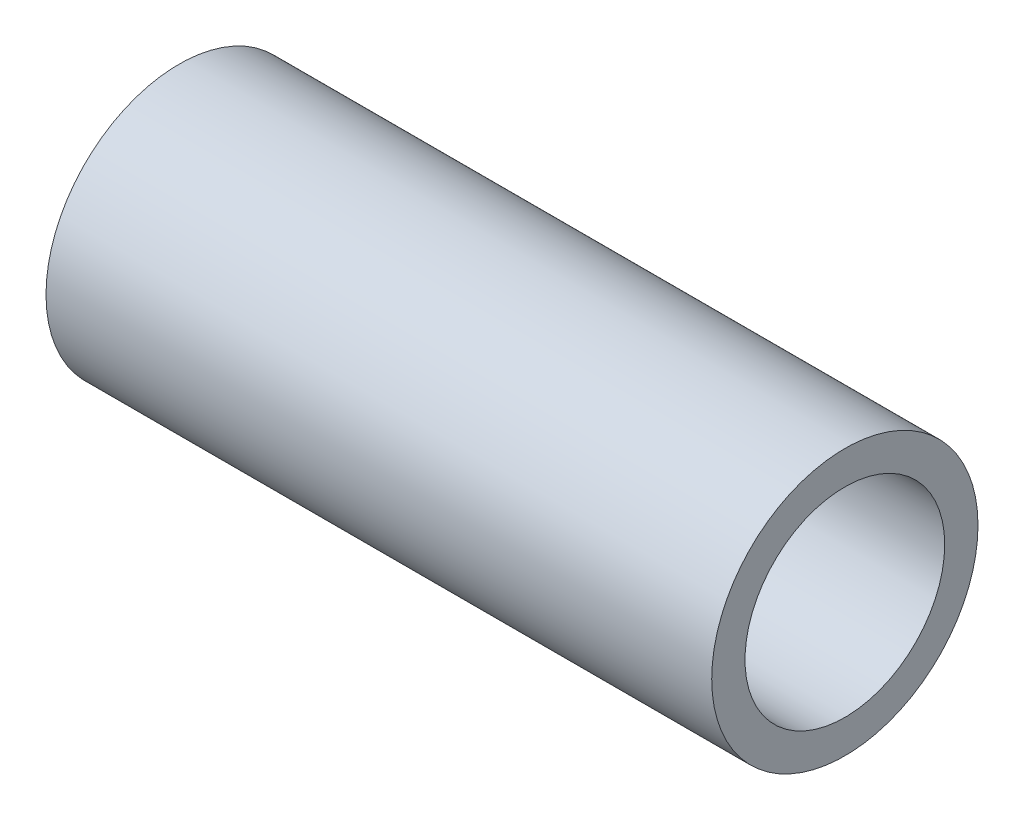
from build123d import *

# Parameters (mm, degrees)
SKETCH1_R           = 12
SKETCH1_R_2         = 9
BOSS_EXTRUDE1_DEPTH = 30


with BuildPart() as part:
    # Sketch1 → Boss-Extrude1 (new, symmetric)
    with BuildSketch(Plane(origin=(0, 0, 0), x_dir=(0, 0, -1), z_dir=(1, 0, 0))):
        Circle(SKETCH1_R)
        Circle(SKETCH1_R_2, mode=Mode.SUBTRACT)
    extrude(amount=BOSS_EXTRUDE1_DEPTH, both=True)


solid = part.part
